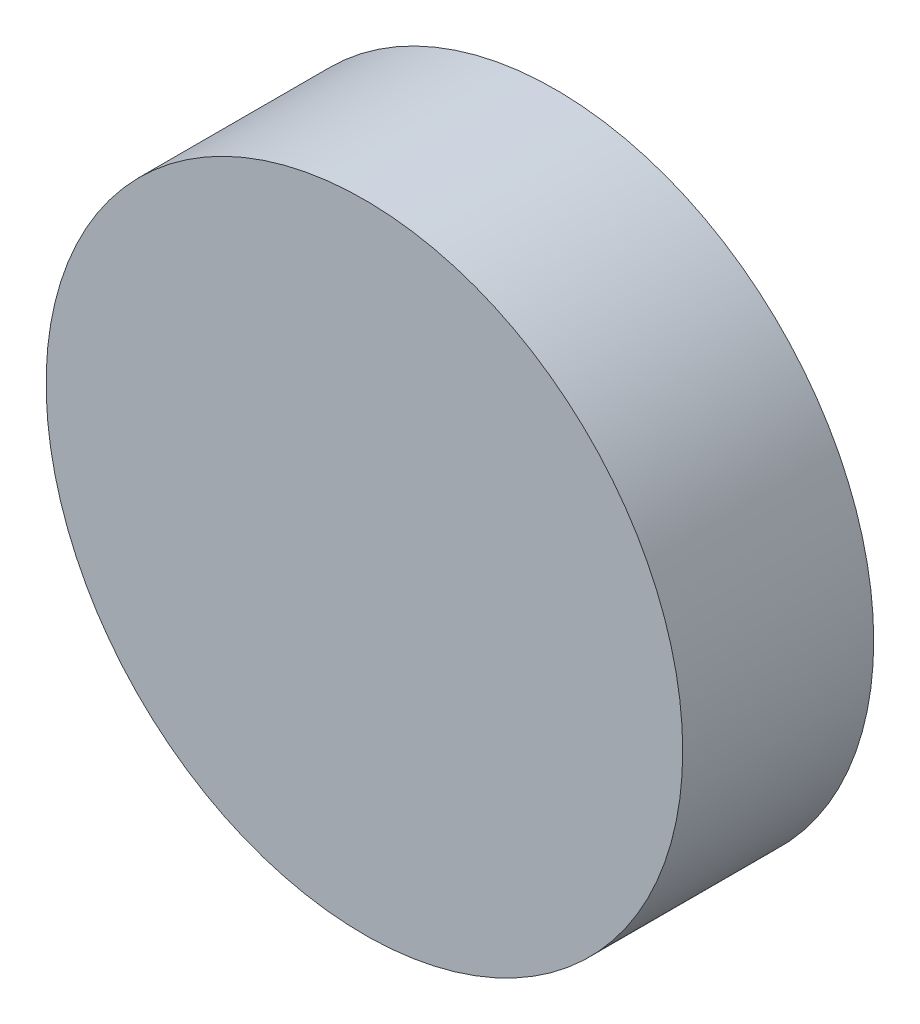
ISO-10303-21;
HEADER;
FILE_DESCRIPTION(('STEP AP214'),'2;1');
FILE_NAME('part.step','',(''),(''),'','','');
FILE_SCHEMA(('AUTOMOTIVE_DESIGN { 1 0 10303 214 1 1 1 1 }'));
ENDSEC;
DATA;
#1=APPLICATION_CONTEXT('core data for automotive mechanical design processes');
#2=APPLICATION_PROTOCOL_DEFINITION('international standard','automotive_design',2000,#1);
#3=PRODUCT_CONTEXT('',#1,'mechanical');
#4=PRODUCT('Part','Part','',(#3));
#5=PRODUCT_RELATED_PRODUCT_CATEGORY('part','',(#4));
#6=PRODUCT_DEFINITION_FORMATION('','',#4);
#7=PRODUCT_DEFINITION_CONTEXT('part definition',#1,'design');
#8=PRODUCT_DEFINITION('design','',#6,#7);
#9=PRODUCT_DEFINITION_SHAPE('','',#8);
#10=(LENGTH_UNIT() NAMED_UNIT(*) SI_UNIT(.MILLI.,.METRE.));
#11=(NAMED_UNIT(*) PLANE_ANGLE_UNIT() SI_UNIT($,.RADIAN.));
#12=(NAMED_UNIT(*) SI_UNIT($,.STERADIAN.) SOLID_ANGLE_UNIT());
#13=UNCERTAINTY_MEASURE_WITH_UNIT(LENGTH_MEASURE(1.E-05),#10,'distance_accuracy_value','');
#14=(GEOMETRIC_REPRESENTATION_CONTEXT(3) GLOBAL_UNCERTAINTY_ASSIGNED_CONTEXT((#13)) GLOBAL_UNIT_ASSIGNED_CONTEXT((#10,
#11,#12)) REPRESENTATION_CONTEXT('',''));
#15=CARTESIAN_POINT('',(0.,0.,0.));
#16=DIRECTION('',(0.,0.,1.));
#17=DIRECTION('',(1.,0.,0.));
#18=AXIS2_PLACEMENT_3D('',#15,#16,#17);
#19=CARTESIAN_POINT('',(0.,0.,-12.));
#20=DIRECTION('',(0.,0.,1.));
#21=DIRECTION('',(1.,0.,0.));
#22=AXIS2_PLACEMENT_3D('',#19,#20,#21);
#23=CYLINDRICAL_SURFACE('',#22,20.);
#24=CARTESIAN_POINT('',(0.,0.,-12.));
#25=DIRECTION('',(0.,0.,1.));
#26=DIRECTION('',(1.,0.,0.));
#27=AXIS2_PLACEMENT_3D('',#24,#25,#26);
#28=CIRCLE('',#27,20.);
#29=CARTESIAN_POINT('',(20.,0.,-12.));
#30=VERTEX_POINT('',#29);
#31=EDGE_CURVE('E10',#30,#30,#28,.T.);
#32=ORIENTED_EDGE('',*,*,#31,.T.);
#33=EDGE_LOOP('',(#32));
#34=FACE_BOUND('',#33,.T.);
#35=CARTESIAN_POINT('',(0.,0.,0.));
#36=DIRECTION('',(0.,0.,1.));
#37=DIRECTION('',(1.,0.,0.));
#38=AXIS2_PLACEMENT_3D('',#35,#36,#37);
#39=CIRCLE('',#38,20.);
#40=CARTESIAN_POINT('',(20.,0.,0.));
#41=VERTEX_POINT('',#40);
#42=EDGE_CURVE('E1356',#41,#41,#39,.T.);
#43=ORIENTED_EDGE('',*,*,#42,.F.);
#44=EDGE_LOOP('',(#43));
#45=FACE_BOUND('',#44,.T.);
#46=ADVANCED_FACE('F1350',(#34,#45),#23,.T.);
#47=CARTESIAN_POINT('',(0.,0.,-12.));
#48=DIRECTION('',(0.,0.,1.));
#49=DIRECTION('',(1.,0.,0.));
#50=AXIS2_PLACEMENT_3D('',#47,#48,#49);
#51=PLANE('',#50);
#52=ORIENTED_EDGE('',*,*,#31,.F.);
#53=EDGE_LOOP('',(#52));
#54=FACE_BOUND('',#53,.T.);
#55=ADVANCED_FACE('F1365',(#54),#51,.F.);
#56=CARTESIAN_POINT('',(0.,0.,0.));
#57=DIRECTION('',(0.,0.,1.));
#58=DIRECTION('',(1.,0.,0.));
#59=AXIS2_PLACEMENT_3D('',#56,#57,#58);
#60=PLANE('',#59);
#61=ORIENTED_EDGE('',*,*,#42,.T.);
#62=EDGE_LOOP('',(#61));
#63=FACE_BOUND('',#62,.T.);
#64=ADVANCED_FACE('F1362',(#63),#60,.T.);
#65=CLOSED_SHELL('',(#46,#55,#64));
#66=MANIFOLD_SOLID_BREP('B2',#65);
#67=ADVANCED_BREP_SHAPE_REPRESENTATION('',(#18,#66),#14);
#68=SHAPE_DEFINITION_REPRESENTATION(#9,#67);
ENDSEC;
END-ISO-10303-21;
